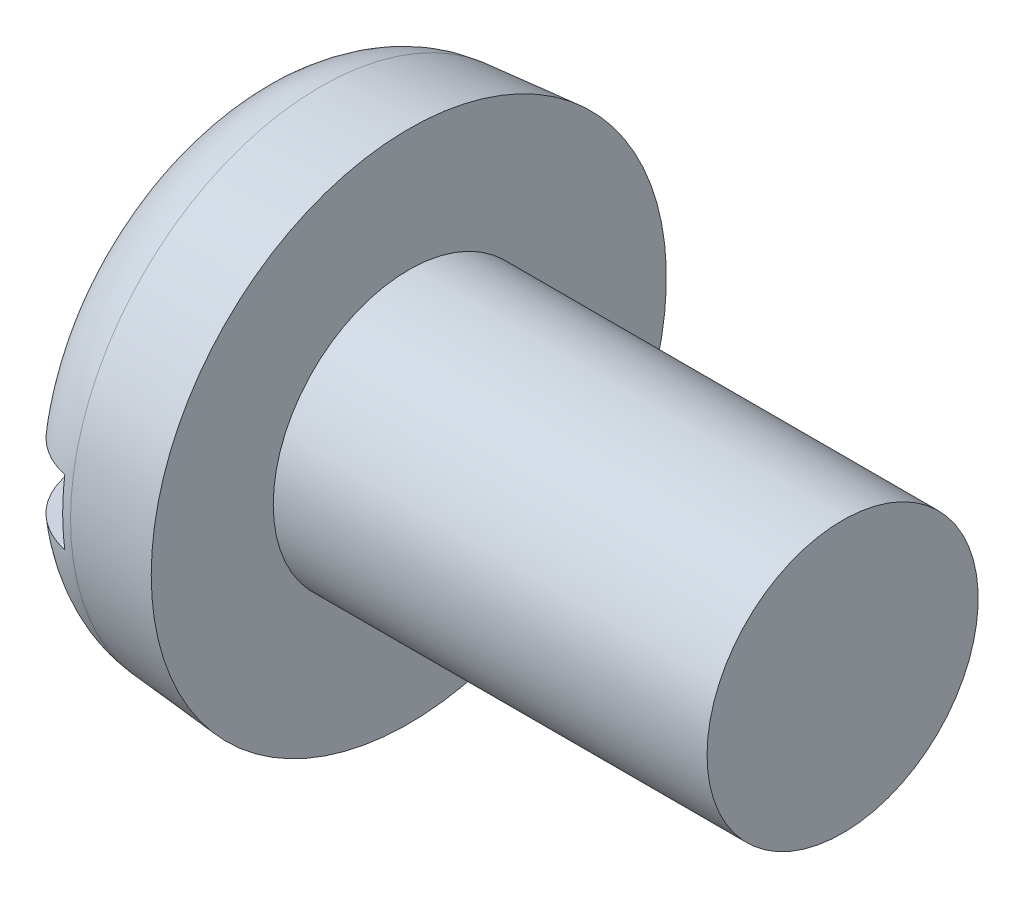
ISO-10303-21;
HEADER;
FILE_DESCRIPTION(('STEP AP214'),'2;1');
FILE_NAME('part.step','',(''),(''),'','','');
FILE_SCHEMA(('AUTOMOTIVE_DESIGN { 1 0 10303 214 1 1 1 1 }'));
ENDSEC;
DATA;
#1=APPLICATION_CONTEXT('core data for automotive mechanical design processes');
#2=APPLICATION_PROTOCOL_DEFINITION('international standard','automotive_design',2000,#1);
#3=PRODUCT_CONTEXT('',#1,'mechanical');
#4=PRODUCT('Part','Part','',(#3));
#5=PRODUCT_RELATED_PRODUCT_CATEGORY('part','',(#4));
#6=PRODUCT_DEFINITION_FORMATION('','',#4);
#7=PRODUCT_DEFINITION_CONTEXT('part definition',#1,'design');
#8=PRODUCT_DEFINITION('design','',#6,#7);
#9=PRODUCT_DEFINITION_SHAPE('','',#8);
#10=(LENGTH_UNIT() NAMED_UNIT(*) SI_UNIT(.MILLI.,.METRE.));
#11=(NAMED_UNIT(*) PLANE_ANGLE_UNIT() SI_UNIT($,.RADIAN.));
#12=(NAMED_UNIT(*) SI_UNIT($,.STERADIAN.) SOLID_ANGLE_UNIT());
#13=UNCERTAINTY_MEASURE_WITH_UNIT(LENGTH_MEASURE(1.E-05),#10,'distance_accuracy_value','');
#14=(GEOMETRIC_REPRESENTATION_CONTEXT(3) GLOBAL_UNCERTAINTY_ASSIGNED_CONTEXT((#13)) GLOBAL_UNIT_ASSIGNED_CONTEXT((#10,
#11,#12)) REPRESENTATION_CONTEXT('',''));
#15=CARTESIAN_POINT('',(0.,0.,0.));
#16=DIRECTION('',(0.,0.,1.));
#17=DIRECTION('',(1.,0.,0.));
#18=AXIS2_PLACEMENT_3D('',#15,#16,#17);
#19=CARTESIAN_POINT('',(0.,0.,0.));
#20=DIRECTION('',(-1.,0.,0.));
#21=DIRECTION('',(0.,0.,1.));
#22=AXIS2_PLACEMENT_3D('',#19,#20,#21);
#23=PLANE('',#22);
#24=DIRECTION('',(0.,0.,-1.));
#25=VECTOR('',#24,1.);
#26=CARTESIAN_POINT('',(0.,0.599999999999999,4.75));
#27=LINE('',#26,#25);
#28=CARTESIAN_POINT('',(0.,0.599999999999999,3.05466870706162));
#29=VERTEX_POINT('',#28);
#30=CARTESIAN_POINT('',(0.,0.599999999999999,-3.05466870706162));
#31=VERTEX_POINT('',#30);
#32=EDGE_CURVE('E85',#29,#31,#27,.T.);
#33=ORIENTED_EDGE('',*,*,#32,.F.);
#34=CARTESIAN_POINT('',(0.,0.,0.));
#35=DIRECTION('',(-1.,0.,0.));
#36=DIRECTION('',(0.,0.,1.));
#37=AXIS2_PLACEMENT_3D('',#34,#35,#36);
#38=CIRCLE('',#37,3.11303724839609);
#39=EDGE_CURVE('E91',#29,#31,#38,.T.);
#40=ORIENTED_EDGE('',*,*,#39,.T.);
#41=EDGE_LOOP('',(#33,#40));
#42=FACE_BOUND('',#41,.T.);
#43=ADVANCED_FACE('F32',(#42),#23,.T.);
#44=CARTESIAN_POINT('',(-25.4,0.,0.));
#45=DIRECTION('',(-1.,0.,0.));
#46=DIRECTION('',(0.,0.,1.));
#47=AXIS2_PLACEMENT_3D('',#44,#45,#46);
#48=CYLINDRICAL_SURFACE('',#47,2.5);
#49=CARTESIAN_POINT('',(11.,0.,0.));
#50=DIRECTION('',(-1.,0.,0.));
#51=DIRECTION('',(0.,0.,1.));
#52=AXIS2_PLACEMENT_3D('',#49,#50,#51);
#53=CIRCLE('',#52,2.5);
#54=CARTESIAN_POINT('',(11.,0.,2.5));
#55=VERTEX_POINT('',#54);
#56=EDGE_CURVE('E92',#55,#55,#53,.T.);
#57=ORIENTED_EDGE('',*,*,#56,.T.);
#58=EDGE_LOOP('',(#57));
#59=FACE_BOUND('',#58,.T.);
#60=CARTESIAN_POINT('',(3.,0.,0.));
#61=DIRECTION('',(-1.,0.,0.));
#62=DIRECTION('',(0.,0.,1.));
#63=AXIS2_PLACEMENT_3D('',#60,#61,#62);
#64=CIRCLE('',#63,2.5);
#65=CARTESIAN_POINT('',(3.,0.,2.5));
#66=VERTEX_POINT('',#65);
#67=EDGE_CURVE('E149',#66,#66,#64,.T.);
#68=ORIENTED_EDGE('',*,*,#67,.F.);
#69=EDGE_LOOP('',(#68));
#70=FACE_BOUND('',#69,.T.);
#71=ADVANCED_FACE('F137',(#59,#70),#48,.T.);
#72=CARTESIAN_POINT('',(11.,2.5,0.));
#73=DIRECTION('',(1.,0.,0.));
#74=DIRECTION('',(0.,0.,-1.));
#75=AXIS2_PLACEMENT_3D('',#72,#73,#74);
#76=PLANE('',#75);
#77=ORIENTED_EDGE('',*,*,#56,.F.);
#78=EDGE_LOOP('',(#77));
#79=FACE_BOUND('',#78,.T.);
#80=ADVANCED_FACE('F135',(#79),#76,.T.);
#81=DIRECTION('',(0.,0.,1.));
#82=VECTOR('',#81,1.);
#83=CARTESIAN_POINT('',(0.,-0.599999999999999,-4.75));
#84=LINE('',#83,#82);
#85=CARTESIAN_POINT('',(0.,-0.599999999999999,-3.05466870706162));
#86=VERTEX_POINT('',#85);
#87=CARTESIAN_POINT('',(0.,-0.6,3.05466870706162));
#88=VERTEX_POINT('',#87);
#89=EDGE_CURVE('E76',#86,#88,#84,.T.);
#90=ORIENTED_EDGE('',*,*,#89,.F.);
#91=EDGE_CURVE('E83',#86,#88,#38,.T.);
#92=ORIENTED_EDGE('',*,*,#91,.T.);
#93=EDGE_LOOP('',(#90,#92));
#94=FACE_BOUND('',#93,.T.);
#95=ADVANCED_FACE('F82',(#94),#23,.T.);
#96=CARTESIAN_POINT('',(0.,0.,0.));
#97=DIRECTION('',(1.,0.,0.));
#98=DIRECTION('',(0.,0.,-1.));
#99=AXIS2_PLACEMENT_3D('',#96,#97,#98);
#100=CONICAL_SURFACE('',#99,4.48753400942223,0.0872664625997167);
#101=CARTESIAN_POINT('',(1.36926638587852,0.,0.));
#102=DIRECTION('',(-1.,0.,0.));
#103=DIRECTION('',(0.,0.,1.));
#104=AXIS2_PLACEMENT_3D('',#101,#102,#103);
#105=CIRCLE('',#104,4.60732929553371);
#106=CARTESIAN_POINT('',(1.36926638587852,0.,4.60732929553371));
#107=VERTEX_POINT('',#106);
#108=EDGE_CURVE('E95',#107,#107,#105,.F.);
#109=ORIENTED_EDGE('',*,*,#108,.T.);
#110=EDGE_LOOP('',(#109));
#111=FACE_BOUND('',#110,.T.);
#112=CARTESIAN_POINT('',(3.,0.,0.));
#113=DIRECTION('',(-1.,0.,0.));
#114=DIRECTION('',(0.,0.,1.));
#115=AXIS2_PLACEMENT_3D('',#112,#113,#114);
#116=CIRCLE('',#115,4.75);
#117=CARTESIAN_POINT('',(3.,0.,4.75));
#118=VERTEX_POINT('',#117);
#119=EDGE_CURVE('E97',#118,#118,#116,.T.);
#120=ORIENTED_EDGE('',*,*,#119,.T.);
#121=EDGE_LOOP('',(#120));
#122=FACE_BOUND('',#121,.T.);
#123=ADVANCED_FACE('F128',(#111,#122),#100,.T.);
#124=CARTESIAN_POINT('',(3.,2.5,0.));
#125=DIRECTION('',(-1.,0.,0.));
#126=DIRECTION('',(0.,0.,1.));
#127=AXIS2_PLACEMENT_3D('',#124,#125,#126);
#128=PLANE('',#127);
#129=ORIENTED_EDGE('',*,*,#119,.F.);
#130=EDGE_LOOP('',(#129));
#131=FACE_BOUND('',#130,.T.);
#132=ORIENTED_EDGE('',*,*,#67,.T.);
#133=EDGE_LOOP('',(#132));
#134=FACE_BOUND('',#133,.T.);
#135=ADVANCED_FACE('F124',(#131,#134),#128,.F.);
#136=CARTESIAN_POINT('',(1.5,0.,0.));
#137=DIRECTION('',(-1.,0.,0.));
#138=DIRECTION('',(0.,0.,1.));
#139=AXIS2_PLACEMENT_3D('',#136,#137,#138);
#140=TOROIDAL_SURFACE('',#139,3.11303724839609,1.5);
#141=CARTESIAN_POINT('',(0.474243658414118,0.599999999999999,-4.16448807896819));
#142=CARTESIAN_POINT('',(0.535197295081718,0.599999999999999,-4.2222007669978));
#143=CARTESIAN_POINT('',(0.601040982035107,0.599999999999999,-4.27483380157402));
#144=CARTESIAN_POINT('',(0.740675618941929,0.599999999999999,-4.36835495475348));
#145=CARTESIAN_POINT('',(0.814475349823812,0.599999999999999,-4.40922990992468));
#146=CARTESIAN_POINT('',(0.967890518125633,0.599999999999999,-4.47797693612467));
#147=CARTESIAN_POINT('',(1.04750461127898,0.599999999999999,-4.50585200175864));
#148=CARTESIAN_POINT('',(1.21027286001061,0.599999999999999,-4.54777716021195));
#149=CARTESIAN_POINT('',(1.29342617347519,0.599999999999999,-4.56183052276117));
#150=CARTESIAN_POINT('',(1.46061786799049,0.599999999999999,-4.57568541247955));
#151=CARTESIAN_POINT('',(1.54465212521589,0.599999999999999,-4.57553672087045));
#152=CARTESIAN_POINT('',(1.71150157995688,0.599999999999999,-4.56111544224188));
#153=CARTESIAN_POINT('',(1.79431675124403,0.599999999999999,-4.546842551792));
#154=CARTESIAN_POINT('',(1.95628107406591,0.599999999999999,-4.50461633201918));
#155=CARTESIAN_POINT('',(2.03543426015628,0.599999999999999,-4.47667847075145));
#156=CARTESIAN_POINT('',(2.18794473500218,0.599999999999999,-4.40794662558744));
#157=CARTESIAN_POINT('',(2.26130200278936,0.599999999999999,-4.36715259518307));
#158=CARTESIAN_POINT('',(2.40037319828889,0.599999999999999,-4.27376142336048));
#159=CARTESIAN_POINT('',(2.46606492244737,0.599999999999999,-4.22113122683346));
#160=CARTESIAN_POINT('',(2.58775416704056,0.599999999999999,-4.10565865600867));
#161=CARTESIAN_POINT('',(2.64375146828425,0.599999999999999,-4.04281605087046));
#162=CARTESIAN_POINT('',(2.7448997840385,0.599999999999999,-3.90824759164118));
#163=CARTESIAN_POINT('',(2.78997229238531,0.599999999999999,-3.83646274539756));
#164=CARTESIAN_POINT('',(2.86758143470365,0.599999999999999,-3.6864129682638));
#165=CARTESIAN_POINT('',(2.90011748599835,0.599999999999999,-3.60814773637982));
#166=CARTESIAN_POINT('',(2.95215516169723,0.599999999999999,-3.44640006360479));
#167=CARTESIAN_POINT('',(2.9715017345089,0.599999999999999,-3.36286776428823));
#168=CARTESIAN_POINT('',(2.99613620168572,0.599999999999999,-3.19375865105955));
#169=CARTESIAN_POINT('',(3.00142305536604,0.599999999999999,-3.10818168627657));
#170=CARTESIAN_POINT('',(2.9978948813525,0.599999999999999,-2.93593785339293));
#171=CARTESIAN_POINT('',(2.98885075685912,0.599999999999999,-2.84927570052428));
#172=CARTESIAN_POINT('',(2.95661294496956,0.599999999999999,-2.67862588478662));
#173=CARTESIAN_POINT('',(2.93341783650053,0.599999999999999,-2.59463849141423));
#174=CARTESIAN_POINT('',(2.87305940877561,0.599999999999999,-2.43009011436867));
#175=CARTESIAN_POINT('',(2.8356478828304,0.599999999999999,-2.3496201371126));
#176=CARTESIAN_POINT('',(2.74798933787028,0.599999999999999,-2.1959917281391));
#177=CARTESIAN_POINT('',(2.69774036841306,0.599999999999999,-2.12283440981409));
#178=CARTESIAN_POINT('',(2.58515210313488,0.599999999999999,-1.98517825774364));
#179=CARTESIAN_POINT('',(2.52268993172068,0.599999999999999,-1.92077976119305));
#180=CARTESIAN_POINT('',(2.3876474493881,0.599999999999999,-1.80360821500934));
#181=CARTESIAN_POINT('',(2.31506700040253,0.599999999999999,-1.75083532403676));
#182=CARTESIAN_POINT('',(2.16324197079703,0.599999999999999,-1.65981326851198));
#183=CARTESIAN_POINT('',(2.08415844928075,0.599999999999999,-1.62129637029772));
#184=CARTESIAN_POINT('',(1.92036681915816,0.599999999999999,-1.55909823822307));
#185=CARTESIAN_POINT('',(1.83566227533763,0.599999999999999,-1.53540769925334));
#186=CARTESIAN_POINT('',(1.66868507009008,0.599999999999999,-1.50512561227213));
#187=CARTESIAN_POINT('',(1.58658829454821,0.599999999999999,-1.4975631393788));
#188=CARTESIAN_POINT('',(1.42235866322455,0.599999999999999,-1.49703912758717));
#189=CARTESIAN_POINT('',(1.34022582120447,0.599999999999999,-1.50407401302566));
#190=CARTESIAN_POINT('',(1.18200056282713,0.599999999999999,-1.53172166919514));
#191=CARTESIAN_POINT('',(1.10580089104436,0.599999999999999,-1.55172937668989));
#192=CARTESIAN_POINT('',(0.957649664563,0.599999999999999,-1.60381093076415));
#193=CARTESIAN_POINT('',(0.885698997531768,0.599999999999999,-1.63588728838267));
#194=CARTESIAN_POINT('',(0.745245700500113,0.599999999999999,-1.71223681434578));
#195=CARTESIAN_POINT('',(0.676958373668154,0.599999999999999,-1.75690511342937));
#196=CARTESIAN_POINT('',(0.548253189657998,0.599999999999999,-1.85641398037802));
#197=CARTESIAN_POINT('',(0.487837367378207,0.599999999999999,-1.91125716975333));
#198=CARTESIAN_POINT('',(0.372604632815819,0.599999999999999,-2.0333995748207));
#199=CARTESIAN_POINT('',(0.318393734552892,0.599999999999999,-2.10127142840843));
#200=CARTESIAN_POINT('',(0.22172170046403,0.599999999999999,-2.24492747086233));
#201=CARTESIAN_POINT('',(0.179262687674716,0.599999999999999,-2.32071308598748));
#202=CARTESIAN_POINT('',(0.106126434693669,0.599999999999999,-2.48060945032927));
#203=CARTESIAN_POINT('',(0.0758504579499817,0.599999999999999,-2.56490423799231));
#204=CARTESIAN_POINT('',(0.0299480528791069,0.599999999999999,-2.737393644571));
#205=CARTESIAN_POINT('',(0.0143211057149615,0.599999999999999,-2.82558812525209));
#206=CARTESIAN_POINT('',(-0.00166405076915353,0.599999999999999,-3.00295249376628));
#207=CARTESIAN_POINT('',(-0.0020913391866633,0.599999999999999,-3.09211612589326));
#208=CARTESIAN_POINT('',(0.012315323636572,0.599999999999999,-3.26923006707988));
#209=CARTESIAN_POINT('',(0.0271518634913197,0.599999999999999,-3.35718016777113));
#210=CARTESIAN_POINT('',(0.0713942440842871,0.599999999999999,-3.52770551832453));
#211=CARTESIAN_POINT('',(0.100543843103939,0.599999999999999,-3.61034739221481));
#212=CARTESIAN_POINT('',(0.172532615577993,0.599999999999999,-3.7693538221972));
#213=CARTESIAN_POINT('',(0.215353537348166,0.599999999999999,-3.84572657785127));
#214=CARTESIAN_POINT('',(0.294810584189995,0.599999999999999,-3.9625299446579));
#215=CARTESIAN_POINT('',(0.327631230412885,0.599999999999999,-4.00560511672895));
#216=CARTESIAN_POINT('',(0.397705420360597,0.599999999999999,-4.08798619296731));
#217=CARTESIAN_POINT('',(0.434958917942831,0.599999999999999,-4.12729213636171));
#218=CARTESIAN_POINT('',(0.474243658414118,0.599999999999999,-4.16448807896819));
#219=B_SPLINE_CURVE_WITH_KNOTS('',3,(#141,#142,#143,#144,#145,#146,#147,#148,#149,#150,#151,
#152,#153,#154,#155,#156,#157,#158,#159,#160,#161,#162,#163,#164,#165,#166,#167,#168,#169,#170,
#171,#172,#173,#174,#175,#176,#177,#178,#179,#180,#181,#182,#183,#184,#185,#186,#187,#188,#189,
#190,#191,#192,#193,#194,#195,#196,#197,#198,#199,#200,#201,#202,#203,#204,#205,#206,#207,#208,
#209,#210,#211,#212,#213,#214,#215,#216,#217,#218),.UNSPECIFIED.,.T.,.F.,(4,2,2,2,2,2,2,2,2,2,2,
2,2,2,2,2,2,2,2,2,2,2,2,2,2,2,2,2,2,2,2,2,2,2,2,2,2,2,4),(0.,0.251627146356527,
0.503534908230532,0.755384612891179,1.00717472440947,1.25808229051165,1.50899524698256,
1.75962483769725,2.01025533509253,2.26159466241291,2.5129396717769,2.76604060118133,
3.01915329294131,3.27519243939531,3.53125053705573,3.79144347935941,4.05166255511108,
4.31665070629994,4.58167914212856,4.84952563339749,5.1173757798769,5.37990411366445,
5.64226751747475,5.88833003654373,6.13433228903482,6.36961414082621,6.60494497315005,
6.84869102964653,7.09249997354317,7.35191672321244,7.61138030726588,7.87880123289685,
8.14621268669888,8.41240865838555,8.67864978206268,8.94028930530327,9.20158098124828,
9.36375686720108,9.52593106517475),.UNSPECIFIED.);
#220=CARTESIAN_POINT('',(1.2,0.599999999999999,-4.54328342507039));
#221=VERTEX_POINT('',#220);
#222=EDGE_CURVE('E11',#31,#221,#219,.T.);
#223=ORIENTED_EDGE('',*,*,#222,.F.);
#224=ORIENTED_EDGE('',*,*,#39,.F.);
#225=CARTESIAN_POINT('',(0.642058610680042,0.599999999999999,1.78444467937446));
#226=CARTESIAN_POINT('',(0.708203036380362,0.599999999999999,1.73578880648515));
#227=CARTESIAN_POINT('',(0.778279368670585,0.599999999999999,1.69241067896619));
#228=CARTESIAN_POINT('',(0.924661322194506,0.599999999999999,1.61775076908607));
#229=CARTESIAN_POINT('',(1.00097010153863,0.599999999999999,1.58647516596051));
#230=CARTESIAN_POINT('',(1.15801751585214,0.599999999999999,1.537335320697));
#231=CARTESIAN_POINT('',(1.23876602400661,0.599999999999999,1.51950238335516));
#232=CARTESIAN_POINT('',(1.40212199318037,0.599999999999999,1.49831173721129));
#233=CARTESIAN_POINT('',(1.48472861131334,0.599999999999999,1.49494759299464));
#234=CARTESIAN_POINT('',(1.64595983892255,0.599999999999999,1.50270631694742));
#235=CARTESIAN_POINT('',(1.72461257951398,0.599999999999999,1.51326068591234));
#236=CARTESIAN_POINT('',(1.8790539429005,0.599999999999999,1.54733501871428));
#237=CARTESIAN_POINT('',(1.95484205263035,0.599999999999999,1.57085729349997));
#238=CARTESIAN_POINT('',(2.10217401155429,0.599999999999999,1.63005609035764));
#239=CARTESIAN_POINT('',(2.17368023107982,0.599999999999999,1.6658257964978));
#240=CARTESIAN_POINT('',(2.310172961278,0.599999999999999,1.74815983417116));
#241=CARTESIAN_POINT('',(2.37515789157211,0.599999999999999,1.79472677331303));
#242=CARTESIAN_POINT('',(2.50111037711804,0.599999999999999,1.90052230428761));
#243=CARTESIAN_POINT('',(2.56156048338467,0.599999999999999,1.96036731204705));
#244=CARTESIAN_POINT('',(2.67210720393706,0.599999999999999,2.08896077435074));
#245=CARTESIAN_POINT('',(2.72220143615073,0.599999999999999,2.15771127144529));
#246=CARTESIAN_POINT('',(2.81284735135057,0.599999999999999,2.30563751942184));
#247=CARTESIAN_POINT('',(2.85285618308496,0.599999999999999,2.38514674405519));
#248=CARTESIAN_POINT('',(2.91905433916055,0.599999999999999,2.54972911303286));
#249=CARTESIAN_POINT('',(2.94524280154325,0.599999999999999,2.63480260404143));
#250=CARTESIAN_POINT('',(2.98307112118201,0.599999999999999,2.80866920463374));
#251=CARTESIAN_POINT('',(2.9946229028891,0.599999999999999,2.89748154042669));
#252=CARTESIAN_POINT('',(3.00240662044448,0.599999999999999,3.07577878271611));
#253=CARTESIAN_POINT('',(2.998639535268,0.599999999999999,3.16526364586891));
#254=CARTESIAN_POINT('',(2.97592433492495,0.599999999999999,3.34090743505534));
#255=CARTESIAN_POINT('',(2.95720740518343,0.599999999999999,3.42709622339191));
#256=CARTESIAN_POINT('',(2.90529569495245,0.599999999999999,3.59499998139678));
#257=CARTESIAN_POINT('',(2.87210231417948,0.599999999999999,3.67671538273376));
#258=CARTESIAN_POINT('',(2.7928517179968,0.599999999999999,3.83175947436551));
#259=CARTESIAN_POINT('',(2.7470416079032,0.599999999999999,3.90521449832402));
#260=CARTESIAN_POINT('',(2.64356788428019,0.599999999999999,4.04323981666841));
#261=CARTESIAN_POINT('',(2.58590525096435,0.599999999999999,4.10781084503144));
#262=CARTESIAN_POINT('',(2.46128327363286,0.599999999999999,4.22525214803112));
#263=CARTESIAN_POINT('',(2.39447165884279,0.599999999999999,4.27827922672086));
#264=CARTESIAN_POINT('',(2.25282231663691,0.599999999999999,4.37223374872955));
#265=CARTESIAN_POINT('',(2.17798504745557,0.599999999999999,4.41316188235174));
#266=CARTESIAN_POINT('',(2.02319107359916,0.599999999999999,4.48136089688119));
#267=CARTESIAN_POINT('',(1.94329070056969,0.599999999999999,4.50875968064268));
#268=CARTESIAN_POINT('',(1.78001182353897,0.599999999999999,4.54967680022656));
#269=CARTESIAN_POINT('',(1.69663343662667,0.599999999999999,4.5631956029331));
#270=CARTESIAN_POINT('',(1.52922201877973,0.599999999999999,4.57591948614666));
#271=CARTESIAN_POINT('',(1.44519451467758,0.599999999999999,4.57519739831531));
#272=CARTESIAN_POINT('',(1.27845728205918,0.599999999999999,4.55963992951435));
#273=CARTESIAN_POINT('',(1.19574753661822,0.599999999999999,4.54480472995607));
#274=CARTESIAN_POINT('',(1.0340786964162,0.599999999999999,4.50147996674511));
#275=CARTESIAN_POINT('',(0.95511580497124,0.599999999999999,4.47300456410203));
#276=CARTESIAN_POINT('',(0.803072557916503,0.599999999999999,4.40323812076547));
#277=CARTESIAN_POINT('',(0.729992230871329,0.599999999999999,4.36194701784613));
#278=CARTESIAN_POINT('',(0.59154832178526,0.599999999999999,4.26761123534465));
#279=CARTESIAN_POINT('',(0.526207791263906,0.599999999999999,4.21453273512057));
#280=CARTESIAN_POINT('',(0.405289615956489,0.599999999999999,4.09822911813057));
#281=CARTESIAN_POINT('',(0.349712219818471,0.599999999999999,4.03500374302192));
#282=CARTESIAN_POINT('',(0.249458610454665,0.599999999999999,3.89973755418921));
#283=CARTESIAN_POINT('',(0.204862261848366,0.599999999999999,3.82763756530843));
#284=CARTESIAN_POINT('',(0.128249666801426,0.599999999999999,3.67704118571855));
#285=CARTESIAN_POINT('',(0.0962340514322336,0.599999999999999,3.59854447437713));
#286=CARTESIAN_POINT('',(0.0452695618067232,0.599999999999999,3.43641182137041));
#287=CARTESIAN_POINT('',(0.0264776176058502,0.599999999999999,3.35272657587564));
#288=CARTESIAN_POINT('',(0.00296961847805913,0.599999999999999,3.18340853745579));
#289=CARTESIAN_POINT('',(-0.00174593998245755,0.599999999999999,3.09777567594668));
#290=CARTESIAN_POINT('',(0.00293340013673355,0.599999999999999,2.92551527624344));
#291=CARTESIAN_POINT('',(0.0125572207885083,0.599999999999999,2.83889398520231));
#292=CARTESIAN_POINT('',(0.045943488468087,0.599999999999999,2.66839997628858));
#293=CARTESIAN_POINT('',(0.0697105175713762,0.599999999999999,2.58452815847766));
#294=CARTESIAN_POINT('',(0.131206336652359,0.599999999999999,2.42028022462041));
#295=CARTESIAN_POINT('',(0.169188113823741,0.599999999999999,2.3399989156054));
#296=CARTESIAN_POINT('',(0.257932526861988,0.599999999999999,2.18690708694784));
#297=CARTESIAN_POINT('',(0.308683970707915,0.599999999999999,2.11409010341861));
#298=CARTESIAN_POINT('',(0.405756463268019,0.599999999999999,1.9970345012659));
#299=CARTESIAN_POINT('',(0.449343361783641,0.599999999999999,1.9505006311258));
#300=CARTESIAN_POINT('',(0.54185180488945,0.599999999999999,1.86306846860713));
#301=CARTESIAN_POINT('',(0.590773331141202,0.599999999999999,1.82217015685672));
#302=CARTESIAN_POINT('',(0.642058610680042,0.599999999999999,1.78444467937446));
#303=B_SPLINE_CURVE_WITH_KNOTS('',3,(#225,#226,#227,#228,#229,#230,#231,#232,#233,#234,#235,
#236,#237,#238,#239,#240,#241,#242,#243,#244,#245,#246,#247,#248,#249,#250,#251,#252,#253,#254,
#255,#256,#257,#258,#259,#260,#261,#262,#263,#264,#265,#266,#267,#268,#269,#270,#271,#272,#273,
#274,#275,#276,#277,#278,#279,#280,#281,#282,#283,#284,#285,#286,#287,#288,#289,#290,#291,#292,
#293,#294,#295,#296,#297,#298,#299,#300,#301,#302),.UNSPECIFIED.,.T.,.F.,(4,2,2,2,2,2,2,2,2,2,2,
2,2,2,2,2,2,2,2,2,2,2,2,2,2,2,2,2,2,2,2,2,2,2,2,2,2,2,4),(0.,0.24612605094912,0.492377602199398,
0.739200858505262,0.985914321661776,1.22285638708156,1.45984069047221,1.69866969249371,
1.93755643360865,2.19161852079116,2.4457389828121,2.7115111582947,2.97729990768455,
3.24468054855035,3.51204410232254,3.77535136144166,4.03863316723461,4.29708605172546,
4.55551757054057,4.81018291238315,5.06483372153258,5.31702870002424,5.56921519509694,
5.82011227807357,6.07100613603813,6.32164008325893,6.57227524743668,6.8236390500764,
7.07500925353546,7.32815697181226,7.58131738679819,7.83743366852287,8.09355898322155,
8.35381727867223,8.61415993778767,8.87937525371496,9.14435892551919,9.33519415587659,
9.52602873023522),.UNSPECIFIED.);
#304=CARTESIAN_POINT('',(1.2,0.599999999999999,4.54328342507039));
#305=VERTEX_POINT('',#304);
#306=EDGE_CURVE('E109',#305,#29,#303,.T.);
#307=ORIENTED_EDGE('',*,*,#306,.F.);
#308=CARTESIAN_POINT('',(1.2,0.,0.));
#309=DIRECTION('',(-1.,0.,0.));
#310=DIRECTION('',(0.,0.,1.));
#311=AXIS2_PLACEMENT_3D('',#308,#309,#310);
#312=CIRCLE('',#311,4.582731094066);
#313=CARTESIAN_POINT('',(1.2,-0.6,4.54328342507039));
#314=VERTEX_POINT('',#313);
#315=EDGE_CURVE('E103',#305,#314,#312,.F.);
#316=ORIENTED_EDGE('',*,*,#315,.T.);
#317=CARTESIAN_POINT('',(0.642058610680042,-0.6,1.78444467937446));
#318=CARTESIAN_POINT('',(0.570752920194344,-0.6,1.83690352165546));
#319=CARTESIAN_POINT('',(0.503916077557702,-0.6,1.89557553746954));
#320=CARTESIAN_POINT('',(0.380973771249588,-0.6,2.02337981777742));
#321=CARTESIAN_POINT('',(0.324888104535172,-0.6,2.09253096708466));
#322=CARTESIAN_POINT('',(0.225075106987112,-0.6,2.23912059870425));
#323=CARTESIAN_POINT('',(0.181331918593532,-0.6,2.31654826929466));
#324=CARTESIAN_POINT('',(0.10735821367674,-0.6,2.4775679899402));
#325=CARTESIAN_POINT('',(0.0771217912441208,-0.6,2.56115732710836));
#326=CARTESIAN_POINT('',(0.0308710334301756,-0.6,2.732939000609));
#327=CARTESIAN_POINT('',(0.0149771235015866,-0.6,2.82116384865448));
#328=CARTESIAN_POINT('',(-0.0015567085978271,-0.6,2.99904386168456));
#329=CARTESIAN_POINT('',(-0.00219606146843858,-0.6,3.08869907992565));
#330=CARTESIAN_POINT('',(0.0118531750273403,-0.6,3.26558059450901));
#331=CARTESIAN_POINT('',(0.0263341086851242,-0.6,3.35282334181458));
#332=CARTESIAN_POINT('',(0.0700194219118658,-0.6,3.52354291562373));
#333=CARTESIAN_POINT('',(0.099222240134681,-0.6,3.60702014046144));
#334=CARTESIAN_POINT('',(0.170926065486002,-0.6,3.76619303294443));
#335=CARTESIAN_POINT('',(0.213170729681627,-0.6,3.84200419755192));
#336=CARTESIAN_POINT('',(0.309975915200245,-0.6,3.98530836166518));
#337=CARTESIAN_POINT('',(0.364535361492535,-0.6,4.05280208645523));
#338=CARTESIAN_POINT('',(0.483508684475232,-0.6,4.1764763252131));
#339=CARTESIAN_POINT('',(0.5477595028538,-0.6,4.23281374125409));
#340=CARTESIAN_POINT('',(0.684891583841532,-0.6,4.33376627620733));
#341=CARTESIAN_POINT('',(0.757772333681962,-0.6,4.37838209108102));
#342=CARTESIAN_POINT('',(0.909277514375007,-0.6,4.45415785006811));
#343=CARTESIAN_POINT('',(0.98783477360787,-0.6,4.4854521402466));
#344=CARTESIAN_POINT('',(1.14910626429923,-0.6,4.53432193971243));
#345=CARTESIAN_POINT('',(1.23182034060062,-0.6,4.55189796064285));
#346=CARTESIAN_POINT('',(1.39854874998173,-0.6,4.57274942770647));
#347=CARTESIAN_POINT('',(1.48255291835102,-0.6,4.57610622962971));
#348=CARTESIAN_POINT('',(1.64992840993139,-0.6,4.56864397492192));
#349=CARTESIAN_POINT('',(1.73329974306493,-0.6,4.55782514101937));
#350=CARTESIAN_POINT('',(1.89690556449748,-0.6,4.5223590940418));
#351=CARTESIAN_POINT('',(1.97714487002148,-0.6,4.49773409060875));
#352=CARTESIAN_POINT('',(2.13236381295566,-0.6,4.43539277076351));
#353=CARTESIAN_POINT('',(2.20734343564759,-0.6,4.39767641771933));
#354=CARTESIAN_POINT('',(2.35011399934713,-0.6,4.31014761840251));
#355=CARTESIAN_POINT('',(2.41788774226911,-0.6,4.26030712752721));
#356=CARTESIAN_POINT('',(2.54417141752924,-0.6,4.15002218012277));
#357=CARTESIAN_POINT('',(2.60268114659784,-0.6,4.08957749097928));
#358=CARTESIAN_POINT('',(2.70919785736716,-0.6,3.9593981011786));
#359=CARTESIAN_POINT('',(2.75713464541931,-0.6,3.88960598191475));
#360=CARTESIAN_POINT('',(2.84075534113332,-0.6,3.74303514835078));
#361=CARTESIAN_POINT('',(2.8764387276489,-0.6,3.66625613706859));
#362=CARTESIAN_POINT('',(2.93498131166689,-0.6,3.50699921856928));
#363=CARTESIAN_POINT('',(2.95769541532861,-0.6,3.42446799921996));
#364=CARTESIAN_POINT('',(2.98917609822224,-0.6,3.25679047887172));
#365=CARTESIAN_POINT('',(2.99794169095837,-0.6,3.17164399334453));
#366=CARTESIAN_POINT('',(3.00144063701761,-0.6,2.99973325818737));
#367=CARTESIAN_POINT('',(2.99595250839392,-0.6,2.91296452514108));
#368=CARTESIAN_POINT('',(2.97076041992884,-0.6,2.74151789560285));
#369=CARTESIAN_POINT('',(2.95105508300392,-0.6,2.6568402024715));
#370=CARTESIAN_POINT('',(2.8975856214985,-0.6,2.49032583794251));
#371=CARTESIAN_POINT('',(2.86356984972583,-0.6,2.40856994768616));
#372=CARTESIAN_POINT('',(2.78246737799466,-0.6,2.25181146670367));
#373=CARTESIAN_POINT('',(2.73537879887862,-0.6,2.17680984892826));
#374=CARTESIAN_POINT('',(2.6287380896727,-0.6,2.03476656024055));
#375=CARTESIAN_POINT('',(2.56903700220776,-0.6,1.96783656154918));
#376=CARTESIAN_POINT('',(2.43909597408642,-0.6,1.84509773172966));
#377=CARTESIAN_POINT('',(2.36885525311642,-0.6,1.7892897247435));
#378=CARTESIAN_POINT('',(2.22077231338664,-0.6,1.6915159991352));
#379=CARTESIAN_POINT('',(2.14305625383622,-0.6,1.64935982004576));
#380=CARTESIAN_POINT('',(1.98134627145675,-0.6,1.57962775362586));
#381=CARTESIAN_POINT('',(1.89735630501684,-0.6,1.55204276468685));
#382=CARTESIAN_POINT('',(1.73074700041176,-0.6,1.51405337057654));
#383=CARTESIAN_POINT('',(1.64833577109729,-0.6,1.50273689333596));
#384=CARTESIAN_POINT('',(1.48280159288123,-0.6,1.49493998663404));
#385=CARTESIAN_POINT('',(1.39967868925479,-0.6,1.49845862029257));
#386=CARTESIAN_POINT('',(1.23954957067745,-0.6,1.5195684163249));
#387=CARTESIAN_POINT('',(1.16244637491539,-0.6,1.53644040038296));
#388=CARTESIAN_POINT('',(1.01210690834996,-0.6,1.58254863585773));
#389=CARTESIAN_POINT('',(0.938866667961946,-0.6,1.61177190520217));
#390=CARTESIAN_POINT('',(0.828774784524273,-0.6,1.66615585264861));
#391=CARTESIAN_POINT('',(0.789995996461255,-0.6,1.68752043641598));
#392=CARTESIAN_POINT('',(0.714458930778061,-0.6,1.73355428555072));
#393=CARTESIAN_POINT('',(0.677700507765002,-0.6,1.75822331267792));
#394=CARTESIAN_POINT('',(0.642058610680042,-0.6,1.78444467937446));
#395=B_SPLINE_CURVE_WITH_KNOTS('',3,(#317,#318,#319,#320,#321,#322,#323,#324,#325,#326,#327,
#328,#329,#330,#331,#332,#333,#334,#335,#336,#337,#338,#339,#340,#341,#342,#343,#344,#345,#346,
#347,#348,#349,#350,#351,#352,#353,#354,#355,#356,#357,#358,#359,#360,#361,#362,#363,#364,#365,
#366,#367,#368,#369,#370,#371,#372,#373,#374,#375,#376,#377,#378,#379,#380,#381,#382,#383,#384,
#385,#386,#387,#388,#389,#390,#391,#392,#393,#394),.UNSPECIFIED.,.T.,.F.,(4,2,2,2,2,2,2,2,2,2,2,
2,2,2,2,2,2,2,2,2,2,2,2,2,2,2,2,2,2,2,2,2,2,2,2,2,2,2,4),(0.,0.265404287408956,
0.531292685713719,0.796837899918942,1.0622668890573,1.32990433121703,1.59755176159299,
1.86157117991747,2.12556260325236,2.38466409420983,2.64374297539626,2.89886888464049,
3.15397964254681,3.40645291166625,3.65891676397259,3.90993416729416,4.16094762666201,
4.41155844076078,4.66216995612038,4.91336677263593,5.1645691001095,5.41739205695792,
5.67022576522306,5.92583525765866,6.18146282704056,6.44108615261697,6.70073462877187,
6.96515356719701,7.22961053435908,7.49738541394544,7.76518012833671,8.0290593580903,
8.2927735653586,8.54103382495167,8.78927840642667,9.02499451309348,9.2604634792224,
9.39313443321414,9.5257958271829),.UNSPECIFIED.);
#396=EDGE_CURVE('E90',#88,#314,#395,.T.);
#397=ORIENTED_EDGE('',*,*,#396,.F.);
#398=ORIENTED_EDGE('',*,*,#91,.F.);
#399=CARTESIAN_POINT('',(0.474243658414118,-0.599999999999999,-4.16448807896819));
#400=CARTESIAN_POINT('',(0.412409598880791,-0.599999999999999,-4.10593108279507));
#401=CARTESIAN_POINT('',(0.35551684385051,-0.599999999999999,-4.04205754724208));
#402=CARTESIAN_POINT('',(0.253261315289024,-0.599999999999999,-3.90557965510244));
#403=CARTESIAN_POINT('',(0.207914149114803,-0.599999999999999,-3.83296367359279));
#404=CARTESIAN_POINT('',(0.130063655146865,-0.599999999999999,-3.68123851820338));
#405=CARTESIAN_POINT('',(0.0975468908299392,-0.599999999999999,-3.6021362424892));
#406=CARTESIAN_POINT('',(0.0461131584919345,-0.599999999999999,-3.43965944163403));
#407=CARTESIAN_POINT('',(0.027192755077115,-0.599999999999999,-3.35628600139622));
#408=CARTESIAN_POINT('',(0.00320871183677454,-0.599999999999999,-3.18666752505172));
#409=CARTESIAN_POINT('',(-0.00170544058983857,-0.599999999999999,-3.10040138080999));
#410=CARTESIAN_POINT('',(0.00275015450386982,-0.599999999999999,-2.92823768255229));
#411=CARTESIAN_POINT('',(0.012121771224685,-0.599999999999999,-2.84234017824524));
#412=CARTESIAN_POINT('',(0.0450616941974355,-0.599999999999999,-2.67171740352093));
#413=CARTESIAN_POINT('',(0.0688809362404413,-0.6,-2.58704058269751));
#414=CARTESIAN_POINT('',(0.130163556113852,-0.6,-2.42277478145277));
#415=CARTESIAN_POINT('',(0.16762851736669,-0.6,-2.34318639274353));
#416=CARTESIAN_POINT('',(0.255857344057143,-0.6,-2.19000637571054));
#417=CARTESIAN_POINT('',(0.306828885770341,-0.6,-2.11653425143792));
#418=CARTESIAN_POINT('',(0.420399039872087,-0.6,-1.97917572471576));
#419=CARTESIAN_POINT('',(0.482999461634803,-0.6,-1.91529081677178));
#420=CARTESIAN_POINT('',(0.618096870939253,-0.6,-1.79922493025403));
#421=CARTESIAN_POINT('',(0.69057820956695,-0.6,-1.74702578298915));
#422=CARTESIAN_POINT('',(0.843593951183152,-0.6,-1.65617143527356));
#423=CARTESIAN_POINT('',(0.924125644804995,-0.6,-1.61751169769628));
#424=CARTESIAN_POINT('',(1.08726160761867,-0.6,-1.5568894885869));
#425=CARTESIAN_POINT('',(1.16962117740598,-0.6,-1.53427068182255));
#426=CARTESIAN_POINT('',(1.33705452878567,-0.6,-1.50426955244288));
#427=CARTESIAN_POINT('',(1.42212670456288,-0.6,-1.49687837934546));
#428=CARTESIAN_POINT('',(1.58668515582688,-0.6,-1.4977182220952));
#429=CARTESIAN_POINT('',(1.66617813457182,-0.6,-1.50497326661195));
#430=CARTESIAN_POINT('',(1.82279518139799,-0.6,-1.53279061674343));
#431=CARTESIAN_POINT('',(1.89991905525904,-0.6,-1.55335401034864));
#432=CARTESIAN_POINT('',(2.04948924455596,-0.6,-1.6067410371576));
#433=CARTESIAN_POINT('',(2.1219498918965,-0.6,-1.63952477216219));
#434=CARTESIAN_POINT('',(2.26079027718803,-0.6,-1.71610282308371));
#435=CARTESIAN_POINT('',(2.32716854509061,-0.6,-1.75989979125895));
#436=CARTESIAN_POINT('',(2.45624783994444,-0.6,-1.86010993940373));
#437=CARTESIAN_POINT('',(2.51847841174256,-0.6,-1.91712921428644));
#438=CARTESIAN_POINT('',(2.6330655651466,-0.6,-2.04035161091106));
#439=CARTESIAN_POINT('',(2.68541975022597,-0.6,-2.10655695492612));
#440=CARTESIAN_POINT('',(2.78137899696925,-0.6,-2.24995520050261));
#441=CARTESIAN_POINT('',(2.82440841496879,-0.6,-2.32753422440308));
#442=CARTESIAN_POINT('',(2.89698988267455,-0.6,-2.48876491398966));
#443=CARTESIAN_POINT('',(2.92654080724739,-0.599999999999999,-2.57241708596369));
#444=CARTESIAN_POINT('',(2.97147838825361,-0.599999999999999,-2.74436421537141));
#445=CARTESIAN_POINT('',(2.98671795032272,-0.599999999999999,-2.83269773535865));
#446=CARTESIAN_POINT('',(3.0019280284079,-0.599999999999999,-3.01067371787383));
#447=CARTESIAN_POINT('',(3.00189936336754,-0.599999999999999,-3.10031610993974));
#448=CARTESIAN_POINT('',(2.98653324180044,-0.599999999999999,-3.27703669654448));
#449=CARTESIAN_POINT('',(2.97140689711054,-0.599999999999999,-3.36413320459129));
#450=CARTESIAN_POINT('',(2.92646546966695,-0.599999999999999,-3.53445278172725));
#451=CARTESIAN_POINT('',(2.89665181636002,-0.599999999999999,-3.6176762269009));
#452=CARTESIAN_POINT('',(2.82379055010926,-0.599999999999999,-3.77624709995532));
#453=CARTESIAN_POINT('',(2.78099811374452,-0.599999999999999,-3.85171179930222));
#454=CARTESIAN_POINT('',(2.68316564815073,-0.599999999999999,-3.99423591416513));
#455=CARTESIAN_POINT('',(2.62812664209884,-0.599999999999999,-4.06129603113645));
#456=CARTESIAN_POINT('',(2.50827792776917,-0.599999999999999,-4.18404243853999));
#457=CARTESIAN_POINT('',(2.44362896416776,-0.599999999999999,-4.23988572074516));
#458=CARTESIAN_POINT('',(2.3057910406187,-0.599999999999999,-4.33979100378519));
#459=CARTESIAN_POINT('',(2.23260257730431,-0.599999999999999,-4.38385368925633));
#460=CARTESIAN_POINT('',(2.08057460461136,-0.599999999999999,-4.45849174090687));
#461=CARTESIAN_POINT('',(2.00180044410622,-0.599999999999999,-4.4892002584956));
#462=CARTESIAN_POINT('',(1.84020059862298,-0.599999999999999,-4.53687031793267));
#463=CARTESIAN_POINT('',(1.75737522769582,-0.599999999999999,-4.55383292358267));
#464=CARTESIAN_POINT('',(1.59053176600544,-0.599999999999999,-4.5734537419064));
#465=CARTESIAN_POINT('',(1.50652325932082,-0.599999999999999,-4.57619356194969));
#466=CARTESIAN_POINT('',(1.33921886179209,-0.599999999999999,-4.56750581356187));
#467=CARTESIAN_POINT('',(1.25592315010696,-0.599999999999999,-4.55607478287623));
#468=CARTESIAN_POINT('',(1.09252935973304,-0.599999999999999,-4.51940184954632));
#469=CARTESIAN_POINT('',(1.01242810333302,-0.599999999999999,-4.49417405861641));
#470=CARTESIAN_POINT('',(0.857658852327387,-0.599999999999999,-4.4306700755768));
#471=CARTESIAN_POINT('',(0.782984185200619,-0.599999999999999,-4.39241024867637));
#472=CARTESIAN_POINT('',(0.669478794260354,-0.599999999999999,-4.32168602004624));
#473=CARTESIAN_POINT('',(0.628240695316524,-0.599999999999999,-4.29300657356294));
#474=CARTESIAN_POINT('',(0.548844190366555,-0.599999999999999,-4.23166298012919));
#475=CARTESIAN_POINT('',(0.510685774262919,-0.599999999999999,-4.1989988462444));
#476=CARTESIAN_POINT('',(0.474243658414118,-0.599999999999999,-4.16448807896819));
#477=B_SPLINE_CURVE_WITH_KNOTS('',3,(#399,#400,#401,#402,#403,#404,#405,#406,#407,#408,#409,
#410,#411,#412,#413,#414,#415,#416,#417,#418,#419,#420,#421,#422,#423,#424,#425,#426,#427,#428,
#429,#430,#431,#432,#433,#434,#435,#436,#437,#438,#439,#440,#441,#442,#443,#444,#445,#446,#447,
#448,#449,#450,#451,#452,#453,#454,#455,#456,#457,#458,#459,#460,#461,#462,#463,#464,#465,#466,
#467,#468,#469,#470,#471,#472,#473,#474,#475,#476),.UNSPECIFIED.,.T.,.F.,(4,2,2,2,2,2,2,2,2,2,2,
2,2,2,2,2,2,2,2,2,2,2,2,2,2,2,2,2,2,2,2,2,2,2,2,2,2,2,4),(0.,0.25529644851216,0.510936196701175,
0.766307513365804,1.02161428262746,1.27963589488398,1.53769127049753,1.80036244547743,
2.06306411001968,2.330066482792,2.5971104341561,2.86373626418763,3.13027266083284,
3.38515155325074,3.63988226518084,3.87819866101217,4.11653454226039,4.35409900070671,
4.59172072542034,4.84382021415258,5.09598079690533,5.36088081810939,5.62580294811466,
5.89341910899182,6.16102091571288,6.42493252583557,6.6888184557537,6.94781983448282,
7.20679958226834,7.46185384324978,7.71689327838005,7.96932796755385,8.22174311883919,
8.47270835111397,8.72373491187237,8.97450519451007,9.22496172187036,9.37542205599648,
9.52588189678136),.UNSPECIFIED.);
#478=CARTESIAN_POINT('',(1.2,-0.599999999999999,-4.54328342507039));
#479=VERTEX_POINT('',#478);
#480=EDGE_CURVE('E44',#479,#86,#477,.T.);
#481=ORIENTED_EDGE('',*,*,#480,.F.);
#482=EDGE_CURVE('E56',#479,#221,#312,.F.);
#483=ORIENTED_EDGE('',*,*,#482,.T.);
#484=EDGE_LOOP('',(#223,#224,#307,#316,#397,#398,#481,#483));
#485=FACE_BOUND('',#484,.T.);
#486=ORIENTED_EDGE('',*,*,#108,.F.);
#487=EDGE_LOOP('',(#486));
#488=FACE_BOUND('',#487,.T.);
#489=ADVANCED_FACE('F34',(#485,#488),#140,.T.);
#490=CARTESIAN_POINT('',(1.2,0.599999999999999,4.75));
#491=DIRECTION('',(0.,1.,0.));
#492=DIRECTION('',(0.,0.,1.));
#493=AXIS2_PLACEMENT_3D('',#490,#491,#492);
#494=PLANE('',#493);
#495=ORIENTED_EDGE('',*,*,#222,.T.);
#496=DIRECTION('',(0.,0.,-1.));
#497=VECTOR('',#496,1.);
#498=CARTESIAN_POINT('',(1.2,0.599999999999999,4.75));
#499=LINE('',#498,#497);
#500=EDGE_CURVE('E84',#305,#221,#499,.T.);
#501=ORIENTED_EDGE('',*,*,#500,.F.);
#502=ORIENTED_EDGE('',*,*,#306,.T.);
#503=ORIENTED_EDGE('',*,*,#32,.T.);
#504=EDGE_LOOP('',(#495,#501,#502,#503));
#505=FACE_BOUND('',#504,.T.);
#506=ADVANCED_FACE('F116',(#505),#494,.F.);
#507=CARTESIAN_POINT('',(1.2,-0.599999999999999,-4.75));
#508=DIRECTION('',(0.,-1.,0.));
#509=DIRECTION('',(0.,0.,-1.));
#510=AXIS2_PLACEMENT_3D('',#507,#508,#509);
#511=PLANE('',#510);
#512=ORIENTED_EDGE('',*,*,#480,.T.);
#513=ORIENTED_EDGE('',*,*,#89,.T.);
#514=ORIENTED_EDGE('',*,*,#396,.T.);
#515=DIRECTION('',(0.,0.,1.));
#516=VECTOR('',#515,1.);
#517=CARTESIAN_POINT('',(1.2,-0.599999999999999,-4.75));
#518=LINE('',#517,#516);
#519=EDGE_CURVE('E51',#479,#314,#518,.T.);
#520=ORIENTED_EDGE('',*,*,#519,.F.);
#521=EDGE_LOOP('',(#512,#513,#514,#520));
#522=FACE_BOUND('',#521,.T.);
#523=ADVANCED_FACE('F75',(#522),#511,.F.);
#524=CARTESIAN_POINT('',(1.2,0.599999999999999,-4.75));
#525=DIRECTION('',(-1.,0.,0.));
#526=DIRECTION('',(0.,0.,1.));
#527=AXIS2_PLACEMENT_3D('',#524,#525,#526);
#528=PLANE('',#527);
#529=ORIENTED_EDGE('',*,*,#519,.T.);
#530=ORIENTED_EDGE('',*,*,#315,.F.);
#531=ORIENTED_EDGE('',*,*,#500,.T.);
#532=ORIENTED_EDGE('',*,*,#482,.F.);
#533=EDGE_LOOP('',(#529,#530,#531,#532));
#534=FACE_BOUND('',#533,.T.);
#535=ADVANCED_FACE('F115',(#534),#528,.T.);
#536=CLOSED_SHELL('',(#43,#71,#80,#95,#123,#135,#489,#506,#523,#535));
#537=MANIFOLD_SOLID_BREP('B2',#536);
#538=ADVANCED_BREP_SHAPE_REPRESENTATION('',(#18,#537),#14);
#539=SHAPE_DEFINITION_REPRESENTATION(#9,#538);
ENDSEC;
END-ISO-10303-21;
